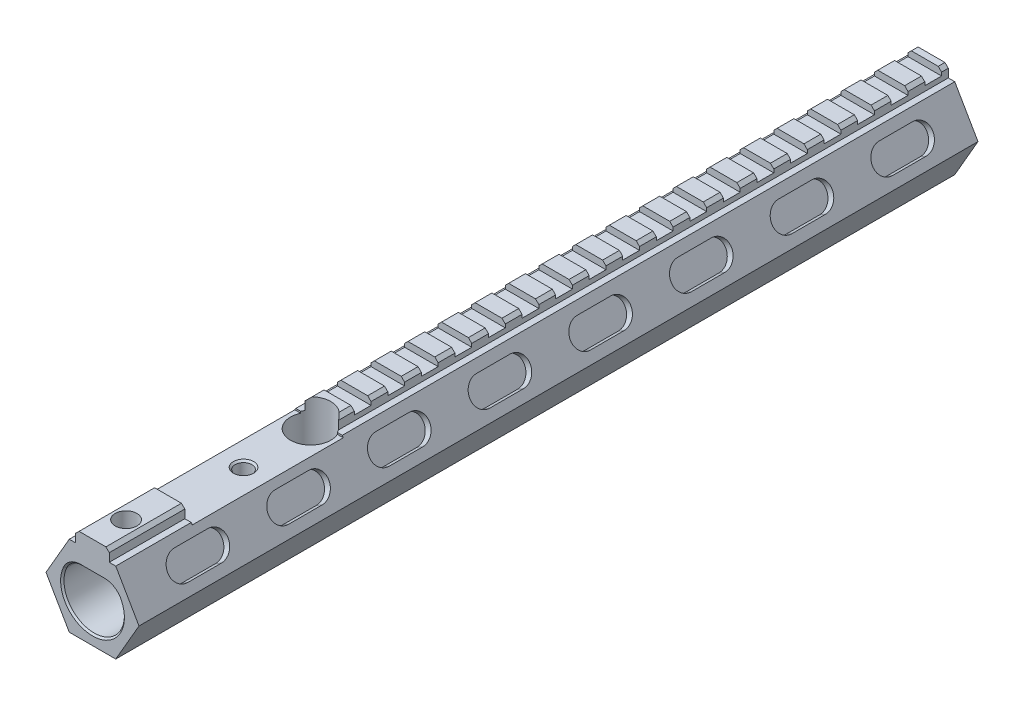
from build123d import *

# Parameters (mm, degrees)
EXTRUDE_2_DEPTH              = 250
CHAMFER_1_SIZE               = 1
SKETCH_5_W                   = 5
SKETCH_5_H                   = 13.159830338
SKETCH_5_W_2                 = 45
CUT_EXTRUDE_1_DEPTH          = 250
SKETCH_5_3_W                 = 5
SKETCH_5_3_H                 = 13.159830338
SKETCH_5_3_W_2               = 45
CUT_EXTRUDE_2_DEPTH          = 250
CUT_EXTRUDE_3_DEPTH          = 21
CHAMFER_2_SIZE               = 0.5
SKETCH_9_W                   = 3.25
SKETCH_9_H                   = 21.091535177
SKETCH_9_5_W                 = 6
SKETCH_9_5_H                 = 22.546123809
SKETCH_9_5_W_2               = 3.25
SKETCH_9_5_H_2               = 16.424785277
HOLE_WIZARD_M6_1_D           = 5
HOLE_WIZARD_M6_1_DEPTH       = 15
HOLE_WIZARD_M6_1_CSINK_D     = 6.05
HOLE_WIZARD_M6_1_CSINK_ANGLE = 90
HOLE_WIZARD_M6_1_TIP         = 1.502151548
HOLE_WIZARD_M6_2_D           = 5
HOLE_WIZARD_M6_2_DEPTH       = 15
HOLE_WIZARD_M6_2_CSINK_D     = 6.05
HOLE_WIZARD_M6_2_CSINK_ANGLE = 90
HOLE_WIZARD_M6_2_TIP         = 1.502151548
HOLE_WIZARD_M8_1_D           = 6.8
HOLE_WIZARD_M8_1_DEPTH       = 25
HOLE_WIZARD_M8_1_CSINK_D     = 8.05
HOLE_WIZARD_M8_1_CSINK_ANGLE = 90
HOLE_WIZARD_M8_1_TIP         = 2.042926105
CUT_EXTRUDE_4_DEPTH          = 2


with BuildPart() as part:
    # Sketch 1 → Extrude 2 (new body)
    with BuildSketch(Plane.XY):
        Polygon((13.856406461, 0), (6.92820323, 12), (5, 12), (5, 15.5), (-5, 15.5), (-5, 12), (-6.92820323, 12), (-13.856406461, 0), (-6.92820323, -12), (6.92820323, -12), align=None)
    extrude(amount=EXTRUDE_2_DEPTH)

    # Chamfer 1
    chamfer_1_edges = [part.edges().sort_by_distance(p)[0] for p in [
        (-5, 15.5, 125),
        (5, 15.5, 125),
    ]]
    chamfer(chamfer_1_edges, length=CHAMFER_1_SIZE)

    # Sketch 5 → Cut-Extrude 1 (cut)
    with BuildSketch(Plane(origin=(0, 0, 0), x_dir=(0, 0, -1), z_dir=(1, 0, 0))):
        with Locations((-4.5, 20.079915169)):
            Rectangle(SKETCH_5_W, SKETCH_5_H)
        with Locations((-14.5, 20.079915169)):
            Rectangle(SKETCH_5_W, SKETCH_5_H)
        with Locations((-24.5, 20.079915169)):
            Rectangle(SKETCH_5_W, SKETCH_5_H)
        with Locations((-34.5, 20.079915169)):
            Rectangle(SKETCH_5_W, SKETCH_5_H)
        with Locations((-44.5, 20.079915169)):
            Rectangle(SKETCH_5_W, SKETCH_5_H)
        with Locations((-54.5, 20.079915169)):
            Rectangle(SKETCH_5_W, SKETCH_5_H)
        with Locations((-64.5, 20.079915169)):
            Rectangle(SKETCH_5_W, SKETCH_5_H)
        with Locations((-74.5, 20.079915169)):
            Rectangle(SKETCH_5_W, SKETCH_5_H)
        with Locations((-84.5, 20.079915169)):
            Rectangle(SKETCH_5_W, SKETCH_5_H)
        with Locations((-94.5, 20.079915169)):
            Rectangle(SKETCH_5_W, SKETCH_5_H)
        with Locations((-104.5, 20.079915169)):
            Rectangle(SKETCH_5_W, SKETCH_5_H)
        with Locations((-114.5, 20.079915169)):
            Rectangle(SKETCH_5_W, SKETCH_5_H)
        with Locations((-124.5, 20.079915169)):
            Rectangle(SKETCH_5_W, SKETCH_5_H)
        with Locations((-134.5, 20.079915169)):
            Rectangle(SKETCH_5_W, SKETCH_5_H)
        with Locations((-144.5, 20.079915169)):
            Rectangle(SKETCH_5_W, SKETCH_5_H)
        with Locations((-154.5, 20.079915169)):
            Rectangle(SKETCH_5_W, SKETCH_5_H)
        with Locations((-164.5, 20.079915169)):
            Rectangle(SKETCH_5_W, SKETCH_5_H)
        with Locations((-174.5, 20.079915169)):
            Rectangle(SKETCH_5_W, SKETCH_5_H)
        with Locations((-205, 18.079915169)):
            Rectangle(SKETCH_5_W_2, SKETCH_5_H)
    extrude(amount=-CUT_EXTRUDE_1_DEPTH, mode=Mode.SUBTRACT)

    # Sketch 5_3 → Cut-Extrude 2 (cut)
    with BuildSketch(Plane(origin=(0, 0, 0), x_dir=(0, 0, -1), z_dir=(1, 0, 0))):
        with Locations((-4.5, 20.079915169)):
            Rectangle(SKETCH_5_3_W, SKETCH_5_3_H)
        with Locations((-14.5, 20.079915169)):
            Rectangle(SKETCH_5_3_W, SKETCH_5_3_H)
        with Locations((-24.5, 20.079915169)):
            Rectangle(SKETCH_5_3_W, SKETCH_5_3_H)
        with Locations((-34.5, 20.079915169)):
            Rectangle(SKETCH_5_3_W, SKETCH_5_3_H)
        with Locations((-44.5, 20.079915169)):
            Rectangle(SKETCH_5_3_W, SKETCH_5_3_H)
        with Locations((-54.5, 20.079915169)):
            Rectangle(SKETCH_5_3_W, SKETCH_5_3_H)
        with Locations((-64.5, 20.079915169)):
            Rectangle(SKETCH_5_3_W, SKETCH_5_3_H)
        with Locations((-74.5, 20.079915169)):
            Rectangle(SKETCH_5_3_W, SKETCH_5_3_H)
        with Locations((-84.5, 20.079915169)):
            Rectangle(SKETCH_5_3_W, SKETCH_5_3_H)
        with Locations((-94.5, 20.079915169)):
            Rectangle(SKETCH_5_3_W, SKETCH_5_3_H)
        with Locations((-104.5, 20.079915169)):
            Rectangle(SKETCH_5_3_W, SKETCH_5_3_H)
        with Locations((-114.5, 20.079915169)):
            Rectangle(SKETCH_5_3_W, SKETCH_5_3_H)
        with Locations((-124.5, 20.079915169)):
            Rectangle(SKETCH_5_3_W, SKETCH_5_3_H)
        with Locations((-134.5, 20.079915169)):
            Rectangle(SKETCH_5_3_W, SKETCH_5_3_H)
        with Locations((-144.5, 20.079915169)):
            Rectangle(SKETCH_5_3_W, SKETCH_5_3_H)
        with Locations((-154.5, 20.079915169)):
            Rectangle(SKETCH_5_3_W, SKETCH_5_3_H)
        with Locations((-164.5, 20.079915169)):
            Rectangle(SKETCH_5_3_W, SKETCH_5_3_H)
        with Locations((-174.5, 20.079915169)):
            Rectangle(SKETCH_5_3_W, SKETCH_5_3_H)
        with Locations((-205, 18.079915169)):
            Rectangle(SKETCH_5_3_W_2, SKETCH_5_3_H)
    extrude(amount=CUT_EXTRUDE_2_DEPTH, mode=Mode.SUBTRACT)

    # Sketch 6 → Cut-Extrude 3 (cut)
    with BuildSketch(Plane.XY.offset(250)):
        with BuildLine():
            Line((-3.620773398, 6.7), (3.620773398, 6.7))
            ThreePointArc((3.620773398, 6.7), (6.301724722, 5.920485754), (8.146740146, 3.825))
            ThreePointArc((8.146740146, 3.825), (0, -9), (-8.146740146, 3.825))
            ThreePointArc((-8.146740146, 3.825), (-6.301724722, 5.920485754), (-3.620773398, 6.7))
        make_face()
    extrude(amount=-CUT_EXTRUDE_3_DEPTH, mode=Mode.SUBTRACT)

    # Chamfer 2
    chamfer_2_edges = [part.edges().sort_by_distance(p)[0] for p in [
        (6.301724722, 5.920485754, 250),
        (0, 6.7, 250),
        (-6.301724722, 5.920485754, 250),
        (0, -9, 250),
    ]]
    chamfer(chamfer_2_edges, length=CHAMFER_2_SIZE)

    # Sketch 9 → Cut-Revolve 3 (revolve, cut)
    with BuildSketch(Plane(origin=(0, 0, 0), x_dir=(0, 0, -1), z_dir=(1, 0, 0))):
        with Locations((-241.625, 15.545767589)):
            Rectangle(SKETCH_9_W, SKETCH_9_H)
    revolve(axis=Axis((0, 26.091535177, 240), (0, -1, 0)), mode=Mode.SUBTRACT)

    # Sketch 9_5 → Cut-Revolve 6 (revolve, cut)
    with BuildSketch(Plane(origin=(0, 0, 0), x_dir=(0, 0, -1), z_dir=(1, 0, 0))):
        with Locations((-188, 6.773061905)):
            Rectangle(SKETCH_9_5_W, SKETCH_9_5_H)
        with Locations((-186.625, -12.712392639)):
            Rectangle(SKETCH_9_5_W_2, SKETCH_9_5_H_2)
    revolve(axis=Axis((0, 18.046123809, 185), (0, -1, 0)), mode=Mode.SUBTRACT)

    # Hole Wizard M6 _1
    with Locations(Plane(origin=(0, 11.5, 0), x_dir=(1, 0, 0), z_dir=(0, 1, 0))):
        with Locations((0, -205)):
            CounterSinkHole(HOLE_WIZARD_M6_1_D / 2, HOLE_WIZARD_M6_1_CSINK_D / 2, depth=HOLE_WIZARD_M6_1_DEPTH, counter_sink_angle=HOLE_WIZARD_M6_1_CSINK_ANGLE)
            with Locations((0, 0, -(HOLE_WIZARD_M6_1_DEPTH + HOLE_WIZARD_M6_1_TIP / 2))):  # 118° drill point
                Cone(0, HOLE_WIZARD_M6_1_D / 2, HOLE_WIZARD_M6_1_TIP, mode=Mode.SUBTRACT)

    # Hole Wizard M6 _2
    with Locations(Plane.XZ.offset(12)):
        with Locations((0, 80)):
            CounterSinkHole(HOLE_WIZARD_M6_2_D / 2, HOLE_WIZARD_M6_2_CSINK_D / 2, depth=HOLE_WIZARD_M6_2_DEPTH, counter_sink_angle=HOLE_WIZARD_M6_2_CSINK_ANGLE)
            with Locations((0, 0, -(HOLE_WIZARD_M6_2_DEPTH + HOLE_WIZARD_M6_2_TIP / 2))):  # 118° drill point
                Cone(0, HOLE_WIZARD_M6_2_D / 2, HOLE_WIZARD_M6_2_TIP, mode=Mode.SUBTRACT)

    # Hole Wizard M8 _1
    with Locations(Plane(origin=(0, 0, 0), x_dir=(-1, 0, 0), z_dir=(0, 0, -1))):
        with Locations((0, 0)):
            CounterSinkHole(HOLE_WIZARD_M8_1_D / 2, HOLE_WIZARD_M8_1_CSINK_D / 2, depth=HOLE_WIZARD_M8_1_DEPTH, counter_sink_angle=HOLE_WIZARD_M8_1_CSINK_ANGLE)
            with Locations((0, 0, -(HOLE_WIZARD_M8_1_DEPTH + HOLE_WIZARD_M8_1_TIP / 2))):  # 118° drill point
                Cone(0, HOLE_WIZARD_M8_1_D / 2, HOLE_WIZARD_M8_1_TIP, mode=Mode.SUBTRACT)

    # Sketch 20 → Cut-Extrude 4 (cut)
    with BuildSketch(Plane(origin=(10.392304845, 6, 0), x_dir=(0, 0, -1), z_dir=(0.8660254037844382, 0.5000000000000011, 0))):
        with BuildLine():
            Line((-204, -4.02820323), (-194, -4.02820323))
            ThreePointArc((-194, -4.02820323), (-190, -0.02820323), (-194, 3.97179677))
            Line((-194, 3.97179677), (-204, 3.97179677))
            ThreePointArc((-204, 3.97179677), (-208, -0.02820323), (-204, -4.02820323))
        make_face()
        with BuildLine():
            Line((-234, 3.97179677), (-224, 3.97179677))
            ThreePointArc((-224, 3.97179677), (-220, -0.02820323), (-224, -4.02820323))
            Line((-224, -4.02820323), (-234, -4.02820323))
            ThreePointArc((-234, -4.02820323), (-238, -0.02820323), (-234, 3.97179677))
        make_face()
        with BuildLine():
            Line((-174, -4.02820323), (-164, -4.02820323))
            ThreePointArc((-164, -4.02820323), (-160, -0.02820323), (-164, 3.97179677))
            Line((-164, 3.97179677), (-174, 3.97179677))
            ThreePointArc((-174, 3.97179677), (-178, -0.02820323), (-174, -4.02820323))
        make_face()
        with BuildLine():
            Line((-144, -4.02820323), (-134, -4.02820323))
            ThreePointArc((-134, -4.02820323), (-130, -0.02820323), (-134, 3.97179677))
            Line((-134, 3.97179677), (-144, 3.97179677))
            ThreePointArc((-144, 3.97179677), (-148, -0.02820323), (-144, -4.02820323))
        make_face()
        with BuildLine():
            Line((-114, -4.02820323), (-104, -4.02820323))
            ThreePointArc((-104, -4.02820323), (-100, -0.02820323), (-104, 3.97179677))
            Line((-104, 3.97179677), (-114, 3.97179677))
            ThreePointArc((-114, 3.97179677), (-118, -0.02820323), (-114, -4.02820323))
        make_face()
        with BuildLine():
            Line((-84, -4.02820323), (-74, -4.02820323))
            ThreePointArc((-74, -4.02820323), (-70, -0.02820323), (-74, 3.97179677))
            Line((-74, 3.97179677), (-84, 3.97179677))
            ThreePointArc((-84, 3.97179677), (-88, -0.02820323), (-84, -4.02820323))
        make_face()
        with BuildLine():
            Line((-54, -4.02820323), (-44, -4.02820323))
            ThreePointArc((-44, -4.02820323), (-40, -0.02820323), (-44, 3.97179677))
            Line((-44, 3.97179677), (-54, 3.97179677))
            ThreePointArc((-54, 3.97179677), (-58, -0.02820323), (-54, -4.02820323))
        make_face()
        with BuildLine():
            Line((-24, -4.02820323), (-14, -4.02820323))
            ThreePointArc((-14, -4.02820323), (-10, -0.02820323), (-14, 3.97179677))
            Line((-14, 3.97179677), (-24, 3.97179677))
            ThreePointArc((-24, 3.97179677), (-28, -0.02820323), (-24, -4.02820323))
        make_face()
    cut_extrude_4 = extrude(amount=-CUT_EXTRUDE_4_DEPTH, mode=Mode.SUBTRACT)

    # Mirror 1: Cut-Extrude 4 across plane
    add(cut_extrude_4.mirror(Plane(origin=(0, 0, 0), x_dir=(0, 0, 1), z_dir=(1, 0, 0))), mode=Mode.SUBTRACT)


solid = part.part
